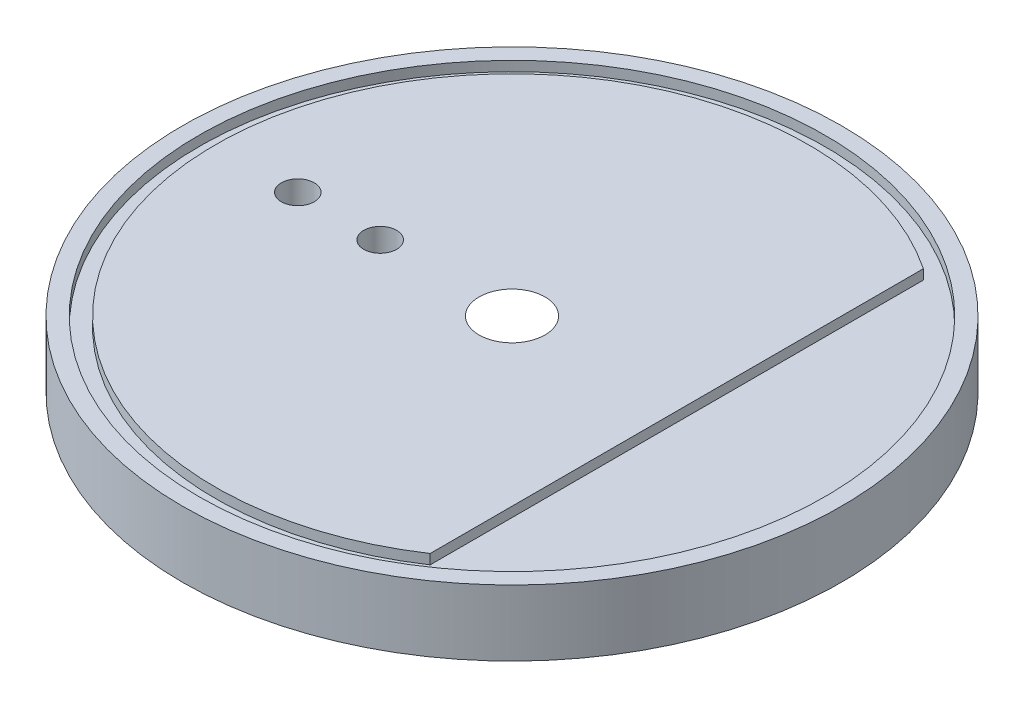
ISO-10303-21;
HEADER;
FILE_DESCRIPTION(('STEP AP214'),'2;1');
FILE_NAME('part.step','',(''),(''),'','','');
FILE_SCHEMA(('AUTOMOTIVE_DESIGN { 1 0 10303 214 1 1 1 1 }'));
ENDSEC;
DATA;
#1=APPLICATION_CONTEXT('core data for automotive mechanical design processes');
#2=APPLICATION_PROTOCOL_DEFINITION('international standard','automotive_design',2000,#1);
#3=PRODUCT_CONTEXT('',#1,'mechanical');
#4=PRODUCT('Part','Part','',(#3));
#5=PRODUCT_RELATED_PRODUCT_CATEGORY('part','',(#4));
#6=PRODUCT_DEFINITION_FORMATION('','',#4);
#7=PRODUCT_DEFINITION_CONTEXT('part definition',#1,'design');
#8=PRODUCT_DEFINITION('design','',#6,#7);
#9=PRODUCT_DEFINITION_SHAPE('','',#8);
#10=(LENGTH_UNIT() NAMED_UNIT(*) SI_UNIT(.MILLI.,.METRE.));
#11=(NAMED_UNIT(*) PLANE_ANGLE_UNIT() SI_UNIT($,.RADIAN.));
#12=(NAMED_UNIT(*) SI_UNIT($,.STERADIAN.) SOLID_ANGLE_UNIT());
#13=UNCERTAINTY_MEASURE_WITH_UNIT(LENGTH_MEASURE(1.E-05),#10,'distance_accuracy_value','');
#14=(GEOMETRIC_REPRESENTATION_CONTEXT(3) GLOBAL_UNCERTAINTY_ASSIGNED_CONTEXT((#13)) GLOBAL_UNIT_ASSIGNED_CONTEXT((#10,
#11,#12)) REPRESENTATION_CONTEXT('',''));
#15=CARTESIAN_POINT('',(0.,0.,0.));
#16=DIRECTION('',(0.,0.,1.));
#17=DIRECTION('',(1.,0.,0.));
#18=AXIS2_PLACEMENT_3D('',#15,#16,#17);
#19=CARTESIAN_POINT('',(0.,-20.,0.));
#20=DIRECTION('',(0.,1.,0.));
#21=DIRECTION('',(0.,0.,1.));
#22=AXIS2_PLACEMENT_3D('',#19,#20,#21);
#23=CYLINDRICAL_SURFACE('',#22,100.);
#24=CARTESIAN_POINT('',(0.,-20.,0.));
#25=DIRECTION('',(0.,1.,0.));
#26=DIRECTION('',(0.,0.,1.));
#27=AXIS2_PLACEMENT_3D('',#24,#25,#26);
#28=CIRCLE('',#27,100.);
#29=CARTESIAN_POINT('',(0.,-20.,100.));
#30=VERTEX_POINT('',#29);
#31=EDGE_CURVE('E11',#30,#30,#28,.T.);
#32=ORIENTED_EDGE('',*,*,#31,.T.);
#33=EDGE_LOOP('',(#32));
#34=FACE_BOUND('',#33,.T.);
#35=CARTESIAN_POINT('',(0.,0.,0.));
#36=DIRECTION('',(0.,1.,0.));
#37=DIRECTION('',(0.,0.,1.));
#38=AXIS2_PLACEMENT_3D('',#35,#36,#37);
#39=CIRCLE('',#38,100.);
#40=CARTESIAN_POINT('',(0.,0.,100.));
#41=VERTEX_POINT('',#40);
#42=EDGE_CURVE('E34',#41,#41,#39,.T.);
#43=ORIENTED_EDGE('',*,*,#42,.F.);
#44=EDGE_LOOP('',(#43));
#45=FACE_BOUND('',#44,.T.);
#46=ADVANCED_FACE('F31',(#34,#45),#23,.T.);
#47=CARTESIAN_POINT('',(0.,-20.,0.));
#48=DIRECTION('',(0.,1.,0.));
#49=DIRECTION('',(0.,0.,1.));
#50=AXIS2_PLACEMENT_3D('',#47,#48,#49);
#51=PLANE('',#50);
#52=CARTESIAN_POINT('',(0.,-20.,0.));
#53=DIRECTION('',(0.,-1.,0.));
#54=DIRECTION('',(0.,0.,-1.));
#55=AXIS2_PLACEMENT_3D('',#52,#53,#54);
#56=CIRCLE('',#55,90.);
#57=CARTESIAN_POINT('',(0.,-20.,-90.));
#58=VERTEX_POINT('',#57);
#59=EDGE_CURVE('E74',#58,#58,#56,.T.);
#60=ORIENTED_EDGE('',*,*,#59,.F.);
#61=EDGE_LOOP('',(#60));
#62=FACE_BOUND('',#61,.T.);
#63=ORIENTED_EDGE('',*,*,#31,.F.);
#64=EDGE_LOOP('',(#63));
#65=FACE_BOUND('',#64,.T.);
#66=ADVANCED_FACE('F92',(#62,#65),#51,.F.);
#67=CARTESIAN_POINT('',(0.,0.,0.));
#68=DIRECTION('',(0.,1.,0.));
#69=DIRECTION('',(0.,0.,1.));
#70=AXIS2_PLACEMENT_3D('',#67,#68,#69);
#71=PLANE('',#70);
#72=CARTESIAN_POINT('',(0.,0.,0.));
#73=DIRECTION('',(0.,1.,0.));
#74=DIRECTION('',(0.,0.,1.));
#75=AXIS2_PLACEMENT_3D('',#72,#73,#74);
#76=CIRCLE('',#75,95.);
#77=CARTESIAN_POINT('',(0.,0.,95.));
#78=VERTEX_POINT('',#77);
#79=EDGE_CURVE('E79',#78,#78,#76,.T.);
#80=ORIENTED_EDGE('',*,*,#79,.F.);
#81=EDGE_LOOP('',(#80));
#82=FACE_BOUND('',#81,.T.);
#83=ORIENTED_EDGE('',*,*,#42,.T.);
#84=EDGE_LOOP('',(#83));
#85=FACE_BOUND('',#84,.T.);
#86=ADVANCED_FACE('F89',(#82,#85),#71,.T.);
#87=CARTESIAN_POINT('',(0.,-3.,0.));
#88=DIRECTION('',(0.,1.,0.));
#89=DIRECTION('',(0.,0.,1.));
#90=AXIS2_PLACEMENT_3D('',#87,#88,#89);
#91=CYLINDRICAL_SURFACE('',#90,95.);
#92=CARTESIAN_POINT('',(0.,-3.,0.));
#93=DIRECTION('',(0.,1.,0.));
#94=DIRECTION('',(0.,0.,1.));
#95=AXIS2_PLACEMENT_3D('',#92,#93,#94);
#96=CIRCLE('',#95,95.);
#97=CARTESIAN_POINT('',(0.,-3.,95.));
#98=VERTEX_POINT('',#97);
#99=EDGE_CURVE('E81',#98,#98,#96,.T.);
#100=ORIENTED_EDGE('',*,*,#99,.F.);
#101=EDGE_LOOP('',(#100));
#102=FACE_BOUND('',#101,.T.);
#103=ORIENTED_EDGE('',*,*,#79,.T.);
#104=EDGE_LOOP('',(#103));
#105=FACE_BOUND('',#104,.T.);
#106=ADVANCED_FACE('F87',(#102,#105),#91,.F.);
#107=CARTESIAN_POINT('',(0.,-3.,0.));
#108=DIRECTION('',(0.,1.,0.));
#109=DIRECTION('',(0.,0.,1.));
#110=AXIS2_PLACEMENT_3D('',#107,#108,#109);
#111=PLANE('',#110);
#112=DIRECTION('',(0.,0.,-1.));
#113=VECTOR('',#112,1.);
#114=CARTESIAN_POINT('',(50.,-3.,-74.8331477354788));
#115=LINE('',#114,#113);
#116=CARTESIAN_POINT('',(50.,-3.,74.8331477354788));
#117=VERTEX_POINT('',#116);
#118=CARTESIAN_POINT('',(50.,-3.,-74.8331477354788));
#119=VERTEX_POINT('',#118);
#120=EDGE_CURVE('E62',#117,#119,#115,.T.);
#121=ORIENTED_EDGE('',*,*,#120,.F.);
#122=CARTESIAN_POINT('',(0.,-3.,0.));
#123=DIRECTION('',(0.,1.,0.));
#124=DIRECTION('',(0.,0.,1.));
#125=AXIS2_PLACEMENT_3D('',#122,#123,#124);
#126=CIRCLE('',#125,90.);
#127=EDGE_CURVE('E52',#119,#117,#126,.T.);
#128=ORIENTED_EDGE('',*,*,#127,.F.);
#129=EDGE_LOOP('',(#121,#128));
#130=FACE_BOUND('',#129,.T.);
#131=ORIENTED_EDGE('',*,*,#99,.T.);
#132=EDGE_LOOP('',(#131));
#133=FACE_BOUND('',#132,.T.);
#134=ADVANCED_FACE('F67',(#130,#133),#111,.T.);
#135=CARTESIAN_POINT('',(0.,-3.,0.));
#136=DIRECTION('',(0.,1.,0.));
#137=DIRECTION('',(0.,0.,1.));
#138=AXIS2_PLACEMENT_3D('',#135,#136,#137);
#139=CYLINDRICAL_SURFACE('',#138,90.);
#140=CARTESIAN_POINT('',(0.,0.,0.));
#141=DIRECTION('',(0.,1.,0.));
#142=DIRECTION('',(0.,0.,1.));
#143=AXIS2_PLACEMENT_3D('',#140,#141,#142);
#144=CIRCLE('',#143,90.);
#145=CARTESIAN_POINT('',(50.,0.,-74.8331477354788));
#146=VERTEX_POINT('',#145);
#147=CARTESIAN_POINT('',(50.,0.,74.8331477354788));
#148=VERTEX_POINT('',#147);
#149=EDGE_CURVE('E45',#146,#148,#144,.T.);
#150=ORIENTED_EDGE('',*,*,#149,.F.);
#151=DIRECTION('',(0.,1.,0.));
#152=VECTOR('',#151,1.);
#153=CARTESIAN_POINT('',(50.,-3.,-74.8331477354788));
#154=LINE('',#153,#152);
#155=EDGE_CURVE('E65',#119,#146,#154,.T.);
#156=ORIENTED_EDGE('',*,*,#155,.F.);
#157=ORIENTED_EDGE('',*,*,#127,.T.);
#158=DIRECTION('',(0.,1.,0.));
#159=VECTOR('',#158,1.);
#160=CARTESIAN_POINT('',(50.,-3.,74.8331477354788));
#161=LINE('',#160,#159);
#162=EDGE_CURVE('E60',#117,#148,#161,.T.);
#163=ORIENTED_EDGE('',*,*,#162,.T.);
#164=EDGE_LOOP('',(#150,#156,#157,#163));
#165=FACE_BOUND('',#164,.T.);
#166=ADVANCED_FACE('F70',(#165),#139,.T.);
#167=CARTESIAN_POINT('',(50.,-3.,-74.8331477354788));
#168=DIRECTION('',(1.,0.,0.));
#169=DIRECTION('',(0.,0.,-1.));
#170=AXIS2_PLACEMENT_3D('',#167,#168,#169);
#171=PLANE('',#170);
#172=DIRECTION('',(0.,0.,-1.));
#173=VECTOR('',#172,1.);
#174=CARTESIAN_POINT('',(50.,0.,-74.8331477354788));
#175=LINE('',#174,#173);
#176=EDGE_CURVE('E64',#148,#146,#175,.T.);
#177=ORIENTED_EDGE('',*,*,#176,.F.);
#178=ORIENTED_EDGE('',*,*,#162,.F.);
#179=ORIENTED_EDGE('',*,*,#120,.T.);
#180=ORIENTED_EDGE('',*,*,#155,.T.);
#181=EDGE_LOOP('',(#177,#178,#179,#180));
#182=FACE_BOUND('',#181,.T.);
#183=ADVANCED_FACE('F61',(#182),#171,.T.);
#184=CARTESIAN_POINT('',(-65.,0.,0.));
#185=DIRECTION('',(0.,1.,0.));
#186=DIRECTION('',(0.,0.,1.));
#187=AXIS2_PLACEMENT_3D('',#184,#185,#186);
#188=CIRCLE('',#187,5.);
#189=CARTESIAN_POINT('',(-65.,0.,5.));
#190=VERTEX_POINT('',#189);
#191=EDGE_CURVE('E146',#190,#190,#188,.T.);
#192=ORIENTED_EDGE('',*,*,#191,.F.);
#193=EDGE_LOOP('',(#192));
#194=FACE_BOUND('',#193,.T.);
#195=CARTESIAN_POINT('',(-40.,0.,0.));
#196=DIRECTION('',(0.,1.,0.));
#197=DIRECTION('',(0.,0.,1.));
#198=AXIS2_PLACEMENT_3D('',#195,#196,#197);
#199=CIRCLE('',#198,5.);
#200=CARTESIAN_POINT('',(-40.,0.,5.));
#201=VERTEX_POINT('',#200);
#202=EDGE_CURVE('E149',#201,#201,#199,.T.);
#203=ORIENTED_EDGE('',*,*,#202,.F.);
#204=EDGE_LOOP('',(#203));
#205=FACE_BOUND('',#204,.T.);
#206=CARTESIAN_POINT('',(0.,0.,0.));
#207=DIRECTION('',(0.,1.,0.));
#208=DIRECTION('',(0.,0.,1.));
#209=AXIS2_PLACEMENT_3D('',#206,#207,#208);
#210=CIRCLE('',#209,10.);
#211=CARTESIAN_POINT('',(0.,0.,10.));
#212=VERTEX_POINT('',#211);
#213=EDGE_CURVE('E155',#212,#212,#210,.T.);
#214=ORIENTED_EDGE('',*,*,#213,.F.);
#215=EDGE_LOOP('',(#214));
#216=FACE_BOUND('',#215,.T.);
#217=ORIENTED_EDGE('',*,*,#176,.T.);
#218=ORIENTED_EDGE('',*,*,#149,.T.);
#219=EDGE_LOOP('',(#217,#218));
#220=FACE_BOUND('',#219,.T.);
#221=ADVANCED_FACE('F93',(#194,#205,#216,#220),#71,.T.);
#222=CARTESIAN_POINT('',(0.,-10.,0.));
#223=DIRECTION('',(0.,-1.,0.));
#224=DIRECTION('',(0.,0.,-1.));
#225=AXIS2_PLACEMENT_3D('',#222,#223,#224);
#226=CYLINDRICAL_SURFACE('',#225,90.);
#227=CARTESIAN_POINT('',(0.,-10.,0.));
#228=DIRECTION('',(0.,-1.,0.));
#229=DIRECTION('',(0.,0.,-1.));
#230=AXIS2_PLACEMENT_3D('',#227,#228,#229);
#231=CIRCLE('',#230,90.);
#232=CARTESIAN_POINT('',(0.,-10.,-90.));
#233=VERTEX_POINT('',#232);
#234=EDGE_CURVE('E77',#233,#233,#231,.T.);
#235=ORIENTED_EDGE('',*,*,#234,.F.);
#236=EDGE_LOOP('',(#235));
#237=FACE_BOUND('',#236,.T.);
#238=ORIENTED_EDGE('',*,*,#59,.T.);
#239=EDGE_LOOP('',(#238));
#240=FACE_BOUND('',#239,.T.);
#241=ADVANCED_FACE('F119',(#237,#240),#226,.F.);
#242=CARTESIAN_POINT('',(0.,-10.,0.));
#243=DIRECTION('',(0.,-1.,0.));
#244=DIRECTION('',(0.,0.,-1.));
#245=AXIS2_PLACEMENT_3D('',#242,#243,#244);
#246=PLANE('',#245);
#247=CARTESIAN_POINT('',(-65.,-10.,0.));
#248=DIRECTION('',(0.,1.,0.));
#249=DIRECTION('',(0.,0.,1.));
#250=AXIS2_PLACEMENT_3D('',#247,#248,#249);
#251=CIRCLE('',#250,5.);
#252=CARTESIAN_POINT('',(-65.,-10.,5.));
#253=VERTEX_POINT('',#252);
#254=EDGE_CURVE('E143',#253,#253,#251,.T.);
#255=ORIENTED_EDGE('',*,*,#254,.T.);
#256=EDGE_LOOP('',(#255));
#257=FACE_BOUND('',#256,.T.);
#258=CARTESIAN_POINT('',(-40.,-10.,0.));
#259=DIRECTION('',(0.,1.,0.));
#260=DIRECTION('',(0.,0.,1.));
#261=AXIS2_PLACEMENT_3D('',#258,#259,#260);
#262=CIRCLE('',#261,5.);
#263=CARTESIAN_POINT('',(-40.,-10.,5.));
#264=VERTEX_POINT('',#263);
#265=EDGE_CURVE('E152',#264,#264,#262,.T.);
#266=ORIENTED_EDGE('',*,*,#265,.T.);
#267=EDGE_LOOP('',(#266));
#268=FACE_BOUND('',#267,.T.);
#269=CARTESIAN_POINT('',(0.,-10.,0.));
#270=DIRECTION('',(0.,1.,0.));
#271=DIRECTION('',(0.,0.,1.));
#272=AXIS2_PLACEMENT_3D('',#269,#270,#271);
#273=CIRCLE('',#272,27.3205080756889);
#274=CARTESIAN_POINT('',(0.,-10.,27.3205080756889));
#275=VERTEX_POINT('',#274);
#276=EDGE_CURVE('E160',#275,#275,#273,.T.);
#277=ORIENTED_EDGE('',*,*,#276,.T.);
#278=EDGE_LOOP('',(#277));
#279=FACE_BOUND('',#278,.T.);
#280=ORIENTED_EDGE('',*,*,#234,.T.);
#281=EDGE_LOOP('',(#280));
#282=FACE_BOUND('',#281,.T.);
#283=ADVANCED_FACE('F122',(#257,#268,#279,#282),#246,.T.);
#284=CARTESIAN_POINT('',(0.,0.,0.));
#285=DIRECTION('',(0.,-1.,0.));
#286=DIRECTION('',(0.,0.,1.));
#287=AXIS2_PLACEMENT_3D('',#284,#285,#286);
#288=CONICAL_SURFACE('',#287,10.,1.0471975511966);
#289=ORIENTED_EDGE('',*,*,#276,.F.);
#290=EDGE_LOOP('',(#289));
#291=FACE_BOUND('',#290,.T.);
#292=ORIENTED_EDGE('',*,*,#213,.T.);
#293=EDGE_LOOP('',(#292));
#294=FACE_BOUND('',#293,.T.);
#295=ADVANCED_FACE('F126',(#291,#294),#288,.F.);
#296=CARTESIAN_POINT('',(-40.,-10.,0.));
#297=DIRECTION('',(0.,1.,0.));
#298=DIRECTION('',(0.,0.,1.));
#299=AXIS2_PLACEMENT_3D('',#296,#297,#298);
#300=CYLINDRICAL_SURFACE('',#299,5.);
#301=ORIENTED_EDGE('',*,*,#265,.F.);
#302=EDGE_LOOP('',(#301));
#303=FACE_BOUND('',#302,.T.);
#304=ORIENTED_EDGE('',*,*,#202,.T.);
#305=EDGE_LOOP('',(#304));
#306=FACE_BOUND('',#305,.T.);
#307=ADVANCED_FACE('F130',(#303,#306),#300,.F.);
#308=CARTESIAN_POINT('',(-65.,-10.,0.));
#309=DIRECTION('',(0.,1.,0.));
#310=DIRECTION('',(0.,0.,1.));
#311=AXIS2_PLACEMENT_3D('',#308,#309,#310);
#312=CYLINDRICAL_SURFACE('',#311,5.);
#313=ORIENTED_EDGE('',*,*,#254,.F.);
#314=EDGE_LOOP('',(#313));
#315=FACE_BOUND('',#314,.T.);
#316=ORIENTED_EDGE('',*,*,#191,.T.);
#317=EDGE_LOOP('',(#316));
#318=FACE_BOUND('',#317,.T.);
#319=ADVANCED_FACE('F134',(#315,#318),#312,.F.);
#320=CLOSED_SHELL('',(#46,#66,#86,#106,#134,#166,#183,#221,#241,#283,#295,#307,#319));
#321=MANIFOLD_SOLID_BREP('B2',#320);
#322=ADVANCED_BREP_SHAPE_REPRESENTATION('',(#18,#321),#14);
#323=SHAPE_DEFINITION_REPRESENTATION(#9,#322);
ENDSEC;
END-ISO-10303-21;
